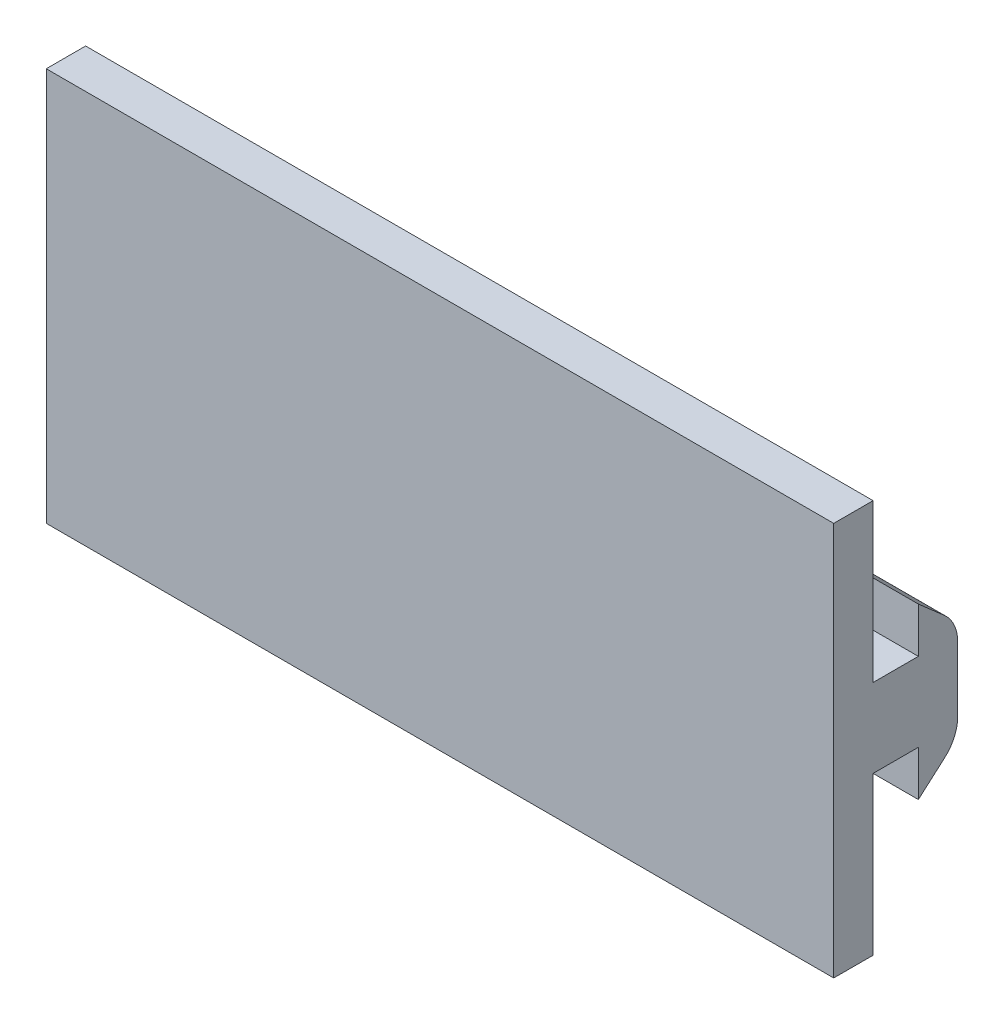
from build123d import *

# Parameters (mm, degrees)
SKETCH1_W           = 83.82
SKETCH1_H           = 25.4
BOSS_EXTRUDE1_DEPTH = 12.7
SKETCH4_W           = 38.1
SKETCH4_H           = 25.4
BOSS_EXTRUDE2_DEPTH = 38.1
SKETCH5_W           = 26.67
SKETCH5_H           = 26.67
CUT_EXTRUDE1_DEPTH  = 19.05
SKETCH7_R           = 3.429
CUT_EXTRUDE2_DEPTH  = 69.556477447
BOSS_EXTRUDE3_DEPTH = 83.82
SKETCH10_W          = 8
SKETCH10_H          = 4
CUT_EXTRUDE3_DEPTH  = 99.831788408
CUT_EXTRUDE4_DEPTH  = 6
SKETCH11_W          = 48.26
SKETCH11_H          = 25.4
CUT_EXTRUDE5_DEPTH  = 99.831788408
SKETCH12_W          = 33.02
SKETCH12_H          = 25.4
CUT_EXTRUDE6_DEPTH  = 45.516896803


with BuildPart() as part:
    # Sketch1 → Boss-Extrude1 (new body)
    with BuildSketch(Plane.XY):
        Rectangle(SKETCH1_W, SKETCH1_H)
    extrude(amount=BOSS_EXTRUDE1_DEPTH)

    # Sketch4 → Boss-Extrude2 (add)
    with BuildSketch(Plane.XY.offset(12.7)):
        Rectangle(SKETCH4_W, SKETCH4_H)
    extrude(amount=BOSS_EXTRUDE2_DEPTH)

    # Sketch5 → Cut-Extrude1 (cut)
    with BuildSketch(Plane(origin=(0, 12.7, 0), x_dir=(1, 0, 0), z_dir=(0, 1, 0))):
        with Locations((0, -31.75)):
            Rectangle(SKETCH5_W, SKETCH5_H)
    extrude(amount=-CUT_EXTRUDE1_DEPTH, mode=Mode.SUBTRACT)

    # Sketch7 → Cut-Extrude2 (cut, through all)
    with BuildSketch(Plane(origin=(0, -6.35, 0), x_dir=(1, 0, 0), z_dir=(0, 1, 0))):
        with Locations(Location((0, -31.75, 0), (0, 0, 270))):
            Circle(SKETCH7_R)
    extrude(amount=-CUT_EXTRUDE2_DEPTH, mode=Mode.SUBTRACT)

    # Sketch8 → Boss-Extrude3 (add)
    with BuildSketch(Plane.ZY.offset(41.91)):
        with BuildLine():
            Line((-5.461, 2.084972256), (-5.461, -2.084972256))
            ThreePointArc((-5.461, -2.084972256), (-5.234177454, -3.134167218), (-4.594220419, -3.995975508))
            Line((-4.594220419, -3.995975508), (-2.921, -5.461))
            Line((-2.921, -5.461), (-2.921, -2.54))
            Line((-2.921, -2.54), (0, -2.54))
            Line((0, -2.54), (0, 2.54))
            Line((0, 2.54), (-2.921, 2.54))
            Line((-2.921, 2.54), (-2.921, 5.461))
            Line((-2.921, 5.461), (-4.594220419, 3.995975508))
            ThreePointArc((-4.594220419, 3.995975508), (-5.234177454, 3.134167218), (-5.461, 2.084972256))
        make_face()
    extrude(amount=-BOSS_EXTRUDE3_DEPTH)

    # Sketch10 → Cut-Extrude3 (cut, through all)
    with BuildSketch(Plane(origin=(41.91, 0, 0), x_dir=(0, 0, -1), z_dir=(1, 0, 0))):
        with Locations((-8.7, 5.62)):
            Rectangle(SKETCH10_W, SKETCH10_H)
    extrude(amount=-CUT_EXTRUDE3_DEPTH, mode=Mode.SUBTRACT)

    # Sketch3 → Cut-Extrude4 (cut)
    with BuildSketch(Plane.XY.offset(12.7)):
        with BuildLine():
            Line((41.91, -6.85999912), (41.91, -7.619999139))
            Line((41.91, -7.619999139), (41.91, -7.819999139))
            Line((41.91, -7.819999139), (31.565, -7.819999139))
            Line((31.565, -7.819999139), (29.050423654, -7.931023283))
            ThreePointArc((29.050423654, -7.931023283), (25.588978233, -9.27852412), (24.142995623, -12.7))
            Line((24.142995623, -12.7), (22.1752021, -12.7))
            ThreePointArc((22.1752021, -12.7), (24.344605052, -7.747051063), (29.45601841, -5.983116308))
            Line((29.45601841, -5.983116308), (32.865217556, -6.1))
            ThreePointArc((32.865217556, -6.1), (33.242134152, -6.253372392), (33.413114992, -6.62263485))
            Line((33.413114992, -6.62263485), (33.415, -6.62263485))
            Line((33.415, -6.62263485), (33.415, -6.71))
            ThreePointArc((33.415, -6.71), (33.458933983, -6.816066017), (33.565, -6.86))
            Line((33.565, -6.86), (34.156206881, -6.860000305))
            ThreePointArc((34.156206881, -6.860000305), (34.266332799, -6.811844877), (34.305750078, -6.698297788))
            ThreePointArc((34.305750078, -6.698297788), (34.304499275, -6.67711281), (34.304059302, -6.655895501))
            Line((34.304059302, -6.655895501), (34.304059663, -6.653448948))
            ThreePointArc((34.304059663, -6.653448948), (34.467161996, -6.262007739), (34.859057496, -6.1))
            Line((34.859057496, -6.1), (34.865217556, -6.1))
            ThreePointArc((34.865217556, -6.1), (35.242134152, -6.253372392), (35.413114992, -6.62263485))
            Line((35.413114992, -6.62263485), (35.415, -6.62263485))
            Line((35.415, -6.62263485), (35.415, -6.71))
            ThreePointArc((35.415, -6.71), (35.458933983, -6.816066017), (35.565, -6.86))
            Line((35.565, -6.86), (36.156206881, -6.860000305))
            ThreePointArc((36.156206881, -6.860000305), (36.266332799, -6.811844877), (36.305750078, -6.698297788))
            ThreePointArc((36.305750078, -6.698297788), (36.304499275, -6.67711281), (36.304059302, -6.655895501))
            Line((36.304059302, -6.655895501), (36.304059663, -6.653448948))
            ThreePointArc((36.304059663, -6.653448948), (36.467161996, -6.262007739), (36.859057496, -6.1))
            Line((36.859057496, -6.1), (36.865218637, -6.1))
            ThreePointArc((36.865218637, -6.1), (37.242151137, -6.253364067), (37.413140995, -6.622635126))
            Line((37.413140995, -6.622635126), (37.415026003, -6.622635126))
            Line((37.415026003, -6.622635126), (37.415026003, -6.710000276))
            ThreePointArc((37.415026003, -6.710000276), (37.458959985, -6.816066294), (37.565026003, -6.860000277))
            Line((37.565026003, -6.860000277), (38.156207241, -6.860000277))
            ThreePointArc((38.156207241, -6.860000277), (38.266333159, -6.811844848), (38.305750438, -6.69829776))
            ThreePointArc((38.305750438, -6.69829776), (38.304499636, -6.677112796), (38.304059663, -6.6558955))
            Line((38.304059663, -6.6558955), (38.304059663, -6.653448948))
            ThreePointArc((38.304059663, -6.653448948), (38.467161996, -6.262007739), (38.859057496, -6.1))
            Line((38.859057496, -6.1), (38.865193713, -6.1))
            ThreePointArc((38.865193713, -6.1), (39.242126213, -6.253364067), (39.413116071, -6.622635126))
            Line((39.413116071, -6.622635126), (39.415001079, -6.622635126))
            Line((39.415001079, -6.622635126), (39.415001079, -6.710000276))
            ThreePointArc((39.415001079, -6.710000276), (39.458935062, -6.816066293), (39.565001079, -6.860000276))
            Line((39.565001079, -6.860000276), (40.156207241, -6.859999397))
            ThreePointArc((40.156207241, -6.859999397), (40.266333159, -6.811843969), (40.305750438, -6.69829688))
            ThreePointArc((40.305750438, -6.69829688), (40.304499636, -6.677111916), (40.304059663, -6.65589462))
            Line((40.304059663, -6.65589462), (40.304059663, -6.653448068))
            ThreePointArc((40.304059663, -6.653448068), (40.467161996, -6.26200686), (40.859057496, -6.09999912))
            Line((40.859057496, -6.09999912), (40.865217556, -6.09999912))
            ThreePointArc((40.865217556, -6.09999912), (41.242134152, -6.253371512), (41.413114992, -6.62263397))
            Line((41.413114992, -6.62263397), (41.415000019, -6.62263397))
            Line((41.415000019, -6.62263397), (41.415000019, -6.70999912))
            ThreePointArc((41.415000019, -6.70999912), (41.458934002, -6.816065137), (41.565000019, -6.85999912))
            Line((41.565000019, -6.85999912), (41.91, -6.85999912))
        make_face()
        with BuildLine():
            Line((-41.910000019, -6.85999912), (-41.910000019, -7.821784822))
            Line((-41.910000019, -7.821784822), (-41.910000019, -8.021784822))
            Line((-41.910000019, -8.021784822), (-22.860000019, -8.021784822))
            Line((-22.860000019, -8.021784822), (-22.860000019, -7.821784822))
            Line((-22.860000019, -7.821784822), (-22.860000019, -7.37263483))
            Line((-22.860000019, -7.37263483), (-22.865217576, -6.099999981))
            ThreePointArc((-22.865217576, -6.099999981), (-23.242134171, -6.253372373), (-23.413115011, -6.62263483))
            Line((-23.413115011, -6.62263483), (-23.415000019, -6.62263483))
            Line((-23.415000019, -6.62263483), (-23.415000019, -6.709999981))
            ThreePointArc((-23.415000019, -6.709999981), (-23.458934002, -6.816065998), (-23.565000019, -6.859999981))
            Line((-23.565000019, -6.859999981), (-24.156207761, -6.860000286))
            ThreePointArc((-24.156207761, -6.860000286), (-24.266333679, -6.811844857), (-24.305750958, -6.698297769))
            ThreePointArc((-24.305750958, -6.698297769), (-24.304480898, -6.676624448), (-24.304059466, -6.654918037))
            Line((-24.304059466, -6.654918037), (-24.304059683, -6.653448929))
            ThreePointArc((-24.304059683, -6.653448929), (-24.467162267, -6.262007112), (-24.859058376, -6.09999912))
            Line((-24.859058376, -6.09999912), (-24.865217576, -6.09999912))
            ThreePointArc((-24.865217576, -6.09999912), (-25.242155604, -6.253318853), (-25.413188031, -6.622557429))
            Line((-25.413188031, -6.622557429), (-25.415075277, -6.622557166))
            Line((-25.415075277, -6.622557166), (-25.415081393, -6.710100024))
            ThreePointArc((-25.415081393, -6.710100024), (-25.459022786, -6.816162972), (-25.565091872, -6.860089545))
            Line((-25.565091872, -6.860089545), (-26.156298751, -6.860048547))
            ThreePointArc((-26.156298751, -6.860048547), (-26.266421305, -6.811885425), (-26.305830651, -6.698335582))
            ThreePointArc((-26.305830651, -6.698335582), (-26.304579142, -6.677170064), (-26.30413698, -6.655972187))
            Line((-26.30413698, -6.655972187), (-26.30413698, -6.653525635))
            ThreePointArc((-26.30413698, -6.653525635), (-26.467212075, -6.262034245), (-26.859135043, -6.09999912))
            Line((-26.859135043, -6.09999912), (-26.865445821, -6.09999912))
            ThreePointArc((-26.865445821, -6.09999912), (-27.242216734, -6.253447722), (-27.413114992, -6.622631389))
            Line((-27.413114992, -6.622631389), (-27.415, -6.622631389))
            Line((-27.415, -6.622631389), (-27.415, -6.71))
            ThreePointArc((-27.415, -6.71), (-27.458933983, -6.816066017), (-27.565, -6.86))
            Line((-27.565, -6.86), (-28.156206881, -6.860000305))
            ThreePointArc((-28.156206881, -6.860000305), (-28.266332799, -6.811844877), (-28.305750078, -6.698297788))
            ThreePointArc((-28.305750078, -6.698297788), (-28.304499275, -6.67711281), (-28.304059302, -6.655895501))
            Line((-28.304059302, -6.655895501), (-28.304059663, -6.653448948))
            ThreePointArc((-28.304059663, -6.653448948), (-28.467161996, -6.262007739), (-28.859057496, -6.1))
            Line((-28.859057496, -6.1), (-28.865217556, -6.1))
            ThreePointArc((-28.865217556, -6.1), (-29.242134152, -6.253372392), (-29.413114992, -6.62263485))
            Line((-29.413114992, -6.62263485), (-29.415, -6.62263485))
            Line((-29.415, -6.62263485), (-29.415, -6.71))
            ThreePointArc((-29.415, -6.71), (-29.458933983, -6.816066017), (-29.565, -6.86))
            Line((-29.565, -6.86), (-30.156206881, -6.860000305))
            ThreePointArc((-30.156206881, -6.860000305), (-30.266332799, -6.811844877), (-30.305750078, -6.698297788))
            ThreePointArc((-30.305750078, -6.698297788), (-30.304499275, -6.67711281), (-30.304059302, -6.655895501))
            Line((-30.304059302, -6.655895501), (-30.304059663, -6.653448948))
            ThreePointArc((-30.304059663, -6.653448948), (-30.467161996, -6.262007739), (-30.859057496, -6.1))
            Line((-30.859057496, -6.1), (-30.865217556, -6.1))
            ThreePointArc((-30.865217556, -6.1), (-31.242134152, -6.253372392), (-31.413114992, -6.62263485))
            Line((-31.413114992, -6.62263485), (-31.415, -6.62263485))
            Line((-31.415, -6.62263485), (-31.415, -6.71))
            ThreePointArc((-31.415, -6.71), (-31.458933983, -6.816066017), (-31.565, -6.86))
            Line((-31.565, -6.86), (-32.156206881, -6.860000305))
            ThreePointArc((-32.156206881, -6.860000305), (-32.266332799, -6.811844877), (-32.305750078, -6.698297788))
            ThreePointArc((-32.305750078, -6.698297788), (-32.304499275, -6.67711281), (-32.304059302, -6.655895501))
            Line((-32.304059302, -6.655895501), (-32.304059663, -6.653448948))
            ThreePointArc((-32.304059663, -6.653448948), (-32.467161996, -6.262007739), (-32.859057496, -6.1))
            Line((-32.859057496, -6.1), (-32.865217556, -6.1))
            ThreePointArc((-32.865217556, -6.1), (-33.242134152, -6.253372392), (-33.413114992, -6.62263485))
            Line((-33.413114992, -6.62263485), (-33.415, -6.62263485))
            Line((-33.415, -6.62263485), (-33.415, -6.71))
            ThreePointArc((-33.415, -6.71), (-33.458933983, -6.816066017), (-33.565, -6.86))
            Line((-33.565, -6.86), (-34.156206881, -6.860000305))
            ThreePointArc((-34.156206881, -6.860000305), (-34.266332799, -6.811844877), (-34.305750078, -6.698297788))
            ThreePointArc((-34.305750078, -6.698297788), (-34.304499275, -6.67711281), (-34.304059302, -6.655895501))
            Line((-34.304059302, -6.655895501), (-34.304059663, -6.653448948))
            ThreePointArc((-34.304059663, -6.653448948), (-34.467161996, -6.262007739), (-34.859057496, -6.1))
            Line((-34.859057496, -6.1), (-34.865217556, -6.1))
            ThreePointArc((-34.865217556, -6.1), (-35.242134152, -6.253372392), (-35.413114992, -6.62263485))
            Line((-35.413114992, -6.62263485), (-35.415, -6.62263485))
            Line((-35.415, -6.62263485), (-35.415, -6.71))
            ThreePointArc((-35.415, -6.71), (-35.458933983, -6.816066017), (-35.565, -6.86))
            Line((-35.565, -6.86), (-36.156206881, -6.860000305))
            ThreePointArc((-36.156206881, -6.860000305), (-36.266332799, -6.811844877), (-36.305750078, -6.698297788))
            ThreePointArc((-36.305750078, -6.698297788), (-36.304499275, -6.67711281), (-36.304059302, -6.655895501))
            Line((-36.304059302, -6.655895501), (-36.304059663, -6.653448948))
            ThreePointArc((-36.304059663, -6.653448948), (-36.467161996, -6.262007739), (-36.859057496, -6.1))
            Line((-36.859057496, -6.1), (-36.865218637, -6.1))
            ThreePointArc((-36.865218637, -6.1), (-37.242151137, -6.253364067), (-37.413140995, -6.622635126))
            Line((-37.413140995, -6.622635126), (-37.415026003, -6.710000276))
            ThreePointArc((-37.415026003, -6.710000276), (-37.458959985, -6.816066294), (-37.565026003, -6.860000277))
            Line((-37.565026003, -6.860000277), (-38.156207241, -6.860000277))
            ThreePointArc((-38.156207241, -6.860000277), (-38.266333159, -6.811844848), (-38.305750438, -6.69829776))
            Line((-38.305750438, -6.69829776), (-38.304059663, -6.653448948))
            ThreePointArc((-38.304059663, -6.653448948), (-38.467161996, -6.262007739), (-38.859057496, -6.1))
            Line((-38.859057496, -6.1), (-38.865193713, -6.1))
            ThreePointArc((-38.865193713, -6.1), (-39.242126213, -6.253364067), (-39.413116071, -6.622635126))
            Line((-39.413116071, -6.622635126), (-39.415001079, -6.710000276))
            ThreePointArc((-39.415001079, -6.710000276), (-39.458935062, -6.816066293), (-39.565001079, -6.860000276))
            Line((-39.565001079, -6.860000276), (-40.156207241, -6.859999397))
            ThreePointArc((-40.156207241, -6.859999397), (-40.266333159, -6.811843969), (-40.305750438, -6.69829688))
            Line((-40.305750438, -6.69829688), (-40.304059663, -6.653448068))
            ThreePointArc((-40.304059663, -6.653448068), (-40.467161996, -6.26200686), (-40.859057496, -6.09999912))
            Line((-40.859057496, -6.09999912), (-40.865217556, -6.09999912))
            ThreePointArc((-40.865217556, -6.09999912), (-41.242134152, -6.253371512), (-41.413114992, -6.62263397))
            Line((-41.413114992, -6.62263397), (-41.415000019, -6.70999912))
            ThreePointArc((-41.415000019, -6.70999912), (-41.458934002, -6.816065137), (-41.565000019, -6.85999912))
            Line((-41.565000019, -6.85999912), (-41.910000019, -6.85999912))
        make_face()
    extrude(amount=-CUT_EXTRUDE4_DEPTH, mode=Mode.SUBTRACT)

    # Sketch11 → Cut-Extrude5 (cut, through all)
    with BuildSketch(Plane.ZY.offset(41.91)):
        with Locations((26.67, 0)):
            Rectangle(SKETCH11_W, SKETCH11_H)
    extrude(amount=-CUT_EXTRUDE5_DEPTH, mode=Mode.SUBTRACT)

    # Sketch12 → Cut-Extrude6 (cut, through all)
    with BuildSketch(Plane.XY.offset(2.54)):
        with Locations((25.4, 0)):
            Rectangle(SKETCH12_W, SKETCH12_H)
    extrude(amount=-CUT_EXTRUDE6_DEPTH, mode=Mode.SUBTRACT)


solid = part.part
